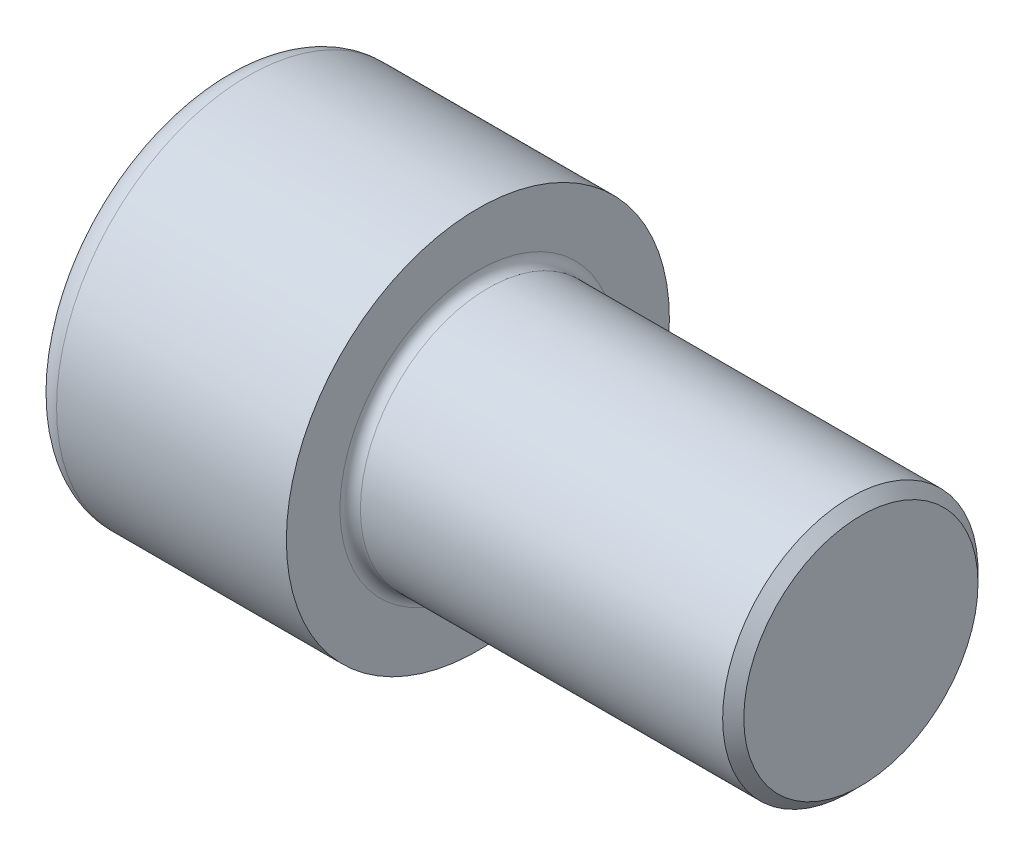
from build123d import *

# Parameters (mm, degrees)
FILLET1_R   = 0.8
FILLET2_R   = 2
HEX_2_DEPTH = 10


with BuildPart() as part:
    # BodySke → Base-Revolve (revolve)
    with BuildSketch(Plane.XY, mode=Mode.PRIVATE) as base_revolve_sk:
        Polygon((0, 0), (0, 15), (20, 15), (20, 10), (49.172, 10), (50, 9.172), (50, 0), align=None)
    revolve(base_revolve_sk.sketch.rotate(Axis((-31.75, 0, 0), (1, 0, 0)), 90), axis=Axis((-31.75, 0, 0), (1, 0, 0)))

    # Fillet1
    fillet1_edges = [part.edges().sort_by_distance(p)[0] for p in [
        (20, 0, -10),
    ]]
    fillet(fillet1_edges, radius=FILLET1_R)

    # Fillet2
    fillet2_edges = [part.edges().sort_by_distance(p)[0] for p in [
        (0, 0, -15),
    ]]
    fillet(fillet2_edges, radius=FILLET2_R)

    # Sketch2 → Hex-PreBroach (revolve, cut)
    with BuildSketch(Plane.XY, mode=Mode.PRIVATE) as hex_prebroach_sk:
        Polygon((0, 8.525), (10, 8.525), (14.921911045, 0), (0, 0), align=None)
    revolve(hex_prebroach_sk.sketch.rotate(Axis((0, 0, 0), (1, 0, 0)), 90), axis=Axis((0, 0, 0), (1, 0, 0)), mode=Mode.SUBTRACT)

    # Sketch3 → Hex 2 (cut)
    with BuildSketch(Plane(origin=(0, 0, 0), x_dir=(0, 0.500000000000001, 0.866025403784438), z_dir=(-1, 0, 0))):
        Polygon((4.921911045, 8.525), (-4.921911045, 8.525), (-9.84382209, 0), (-4.921911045, -8.525), (4.921911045, -8.525), (9.84382209, 0), align=None)
    extrude(amount=-HEX_2_DEPTH, mode=Mode.SUBTRACT)


solid = part.part
